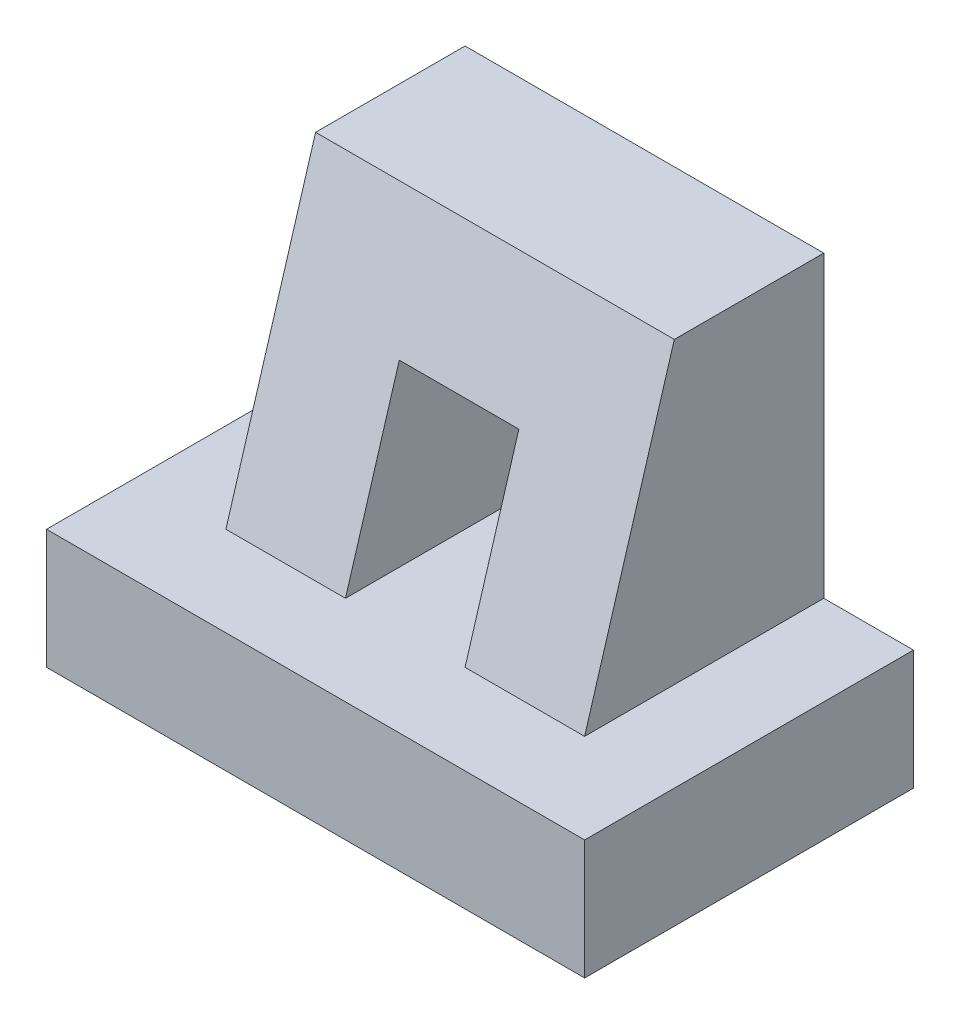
ISO-10303-21;
HEADER;
FILE_DESCRIPTION(('STEP AP214'),'2;1');
FILE_NAME('part.step','',(''),(''),'','','');
FILE_SCHEMA(('AUTOMOTIVE_DESIGN { 1 0 10303 214 1 1 1 1 }'));
ENDSEC;
DATA;
#1=APPLICATION_CONTEXT('core data for automotive mechanical design processes');
#2=APPLICATION_PROTOCOL_DEFINITION('international standard','automotive_design',2000,#1);
#3=PRODUCT_CONTEXT('',#1,'mechanical');
#4=PRODUCT('Part','Part','',(#3));
#5=PRODUCT_RELATED_PRODUCT_CATEGORY('part','',(#4));
#6=PRODUCT_DEFINITION_FORMATION('','',#4);
#7=PRODUCT_DEFINITION_CONTEXT('part definition',#1,'design');
#8=PRODUCT_DEFINITION('design','',#6,#7);
#9=PRODUCT_DEFINITION_SHAPE('','',#8);
#10=(LENGTH_UNIT() NAMED_UNIT(*) SI_UNIT(.MILLI.,.METRE.));
#11=(NAMED_UNIT(*) PLANE_ANGLE_UNIT() SI_UNIT($,.RADIAN.));
#12=(NAMED_UNIT(*) SI_UNIT($,.STERADIAN.) SOLID_ANGLE_UNIT());
#13=UNCERTAINTY_MEASURE_WITH_UNIT(LENGTH_MEASURE(1.E-05),#10,'distance_accuracy_value','');
#14=(GEOMETRIC_REPRESENTATION_CONTEXT(3) GLOBAL_UNCERTAINTY_ASSIGNED_CONTEXT((#13)) GLOBAL_UNIT_ASSIGNED_CONTEXT((#10,
#11,#12)) REPRESENTATION_CONTEXT('',''));
#15=CARTESIAN_POINT('',(0.,0.,0.));
#16=DIRECTION('',(0.,0.,1.));
#17=DIRECTION('',(1.,0.,0.));
#18=AXIS2_PLACEMENT_3D('',#15,#16,#17);
#19=CARTESIAN_POINT('',(0.,20.,0.));
#20=DIRECTION('',(1.,0.,0.));
#21=DIRECTION('',(0.,0.,-1.));
#22=AXIS2_PLACEMENT_3D('',#19,#20,#21);
#23=PLANE('',#22);
#24=DIRECTION('',(0.,0.,1.));
#25=VECTOR('',#24,1.);
#26=CARTESIAN_POINT('',(0.,0.,0.));
#27=LINE('',#26,#25);
#28=CARTESIAN_POINT('',(0.,0.,-55.));
#29=VERTEX_POINT('',#28);
#30=CARTESIAN_POINT('',(0.,0.,0.));
#31=VERTEX_POINT('',#30);
#32=EDGE_CURVE('E202',#29,#31,#27,.T.);
#33=ORIENTED_EDGE('',*,*,#32,.T.);
#34=DIRECTION('',(0.,-1.,0.));
#35=VECTOR('',#34,1.);
#36=CARTESIAN_POINT('',(0.,20.,0.));
#37=LINE('',#36,#35);
#38=CARTESIAN_POINT('',(0.,20.,0.));
#39=VERTEX_POINT('',#38);
#40=EDGE_CURVE('E168',#39,#31,#37,.T.);
#41=ORIENTED_EDGE('',*,*,#40,.F.);
#42=DIRECTION('',(0.,0.,1.));
#43=VECTOR('',#42,1.);
#44=CARTESIAN_POINT('',(0.,20.,0.));
#45=LINE('',#44,#43);
#46=CARTESIAN_POINT('',(0.,20.,-55.));
#47=VERTEX_POINT('',#46);
#48=EDGE_CURVE('E224',#47,#39,#45,.T.);
#49=ORIENTED_EDGE('',*,*,#48,.F.);
#50=DIRECTION('',(0.,-1.,0.));
#51=VECTOR('',#50,1.);
#52=CARTESIAN_POINT('',(0.,20.,-55.));
#53=LINE('',#52,#51);
#54=EDGE_CURVE('E206',#47,#29,#53,.T.);
#55=ORIENTED_EDGE('',*,*,#54,.T.);
#56=EDGE_LOOP('',(#33,#41,#49,#55));
#57=FACE_BOUND('',#56,.T.);
#58=ADVANCED_FACE('F31',(#57),#23,.F.);
#59=CARTESIAN_POINT('',(0.,20.,0.));
#60=DIRECTION('',(0.,0.,-1.));
#61=DIRECTION('',(-1.,0.,0.));
#62=AXIS2_PLACEMENT_3D('',#59,#60,#61);
#63=PLANE('',#62);
#64=DIRECTION('',(1.,0.,0.));
#65=VECTOR('',#64,1.);
#66=CARTESIAN_POINT('',(0.,0.,0.));
#67=LINE('',#66,#65);
#68=CARTESIAN_POINT('',(90.,0.,0.));
#69=VERTEX_POINT('',#68);
#70=EDGE_CURVE('E209',#31,#69,#67,.T.);
#71=ORIENTED_EDGE('',*,*,#70,.T.);
#72=DIRECTION('',(0.,-1.,0.));
#73=VECTOR('',#72,1.);
#74=CARTESIAN_POINT('',(90.,20.,0.));
#75=LINE('',#74,#73);
#76=CARTESIAN_POINT('',(90.,20.,0.));
#77=VERTEX_POINT('',#76);
#78=EDGE_CURVE('E230',#77,#69,#75,.T.);
#79=ORIENTED_EDGE('',*,*,#78,.F.);
#80=DIRECTION('',(1.,0.,0.));
#81=VECTOR('',#80,1.);
#82=CARTESIAN_POINT('',(0.,20.,0.));
#83=LINE('',#82,#81);
#84=EDGE_CURVE('E262',#39,#77,#83,.T.);
#85=ORIENTED_EDGE('',*,*,#84,.F.);
#86=ORIENTED_EDGE('',*,*,#40,.T.);
#87=EDGE_LOOP('',(#71,#79,#85,#86));
#88=FACE_BOUND('',#87,.T.);
#89=ADVANCED_FACE('F191',(#88),#63,.F.);
#90=CARTESIAN_POINT('',(90.,20.,0.));
#91=DIRECTION('',(-1.,0.,0.));
#92=DIRECTION('',(0.,0.,1.));
#93=AXIS2_PLACEMENT_3D('',#90,#91,#92);
#94=PLANE('',#93);
#95=DIRECTION('',(0.,0.,-1.));
#96=VECTOR('',#95,1.);
#97=CARTESIAN_POINT('',(90.,0.,0.));
#98=LINE('',#97,#96);
#99=CARTESIAN_POINT('',(90.,0.,-55.));
#100=VERTEX_POINT('',#99);
#101=EDGE_CURVE('E212',#69,#100,#98,.T.);
#102=ORIENTED_EDGE('',*,*,#101,.T.);
#103=DIRECTION('',(0.,-1.,0.));
#104=VECTOR('',#103,1.);
#105=CARTESIAN_POINT('',(90.,20.,-55.));
#106=LINE('',#105,#104);
#107=CARTESIAN_POINT('',(90.,20.,-55.));
#108=VERTEX_POINT('',#107);
#109=EDGE_CURVE('E226',#108,#100,#106,.T.);
#110=ORIENTED_EDGE('',*,*,#109,.F.);
#111=DIRECTION('',(0.,0.,-1.));
#112=VECTOR('',#111,1.);
#113=CARTESIAN_POINT('',(90.,20.,0.));
#114=LINE('',#113,#112);
#115=EDGE_CURVE('E238',#77,#108,#114,.T.);
#116=ORIENTED_EDGE('',*,*,#115,.F.);
#117=ORIENTED_EDGE('',*,*,#78,.T.);
#118=EDGE_LOOP('',(#102,#110,#116,#117));
#119=FACE_BOUND('',#118,.T.);
#120=ADVANCED_FACE('F196',(#119),#94,.F.);
#121=CARTESIAN_POINT('',(0.,20.,-55.));
#122=DIRECTION('',(0.,0.,1.));
#123=DIRECTION('',(1.,0.,0.));
#124=AXIS2_PLACEMENT_3D('',#121,#122,#123);
#125=PLANE('',#124);
#126=DIRECTION('',(-1.,0.,0.));
#127=VECTOR('',#126,1.);
#128=CARTESIAN_POINT('',(0.,50.,-55.));
#129=LINE('',#128,#127);
#130=CARTESIAN_POINT('',(55.,50.,-55.));
#131=VERTEX_POINT('',#130);
#132=CARTESIAN_POINT('',(35.,50.,-55.));
#133=VERTEX_POINT('',#132);
#134=EDGE_CURVE('E134',#131,#133,#129,.T.);
#135=ORIENTED_EDGE('',*,*,#134,.T.);
#136=DIRECTION('',(0.,-1.,0.));
#137=VECTOR('',#136,1.);
#138=CARTESIAN_POINT('',(35.,20.,-55.));
#139=LINE('',#138,#137);
#140=CARTESIAN_POINT('',(35.,20.,-55.));
#141=VERTEX_POINT('',#140);
#142=EDGE_CURVE('E127',#133,#141,#139,.T.);
#143=ORIENTED_EDGE('',*,*,#142,.T.);
#144=DIRECTION('',(1.,0.,0.));
#145=VECTOR('',#144,1.);
#146=CARTESIAN_POINT('',(0.,20.,-55.));
#147=LINE('',#146,#145);
#148=CARTESIAN_POINT('',(55.,20.,-55.));
#149=VERTEX_POINT('',#148);
#150=EDGE_CURVE('E116',#141,#149,#147,.T.);
#151=ORIENTED_EDGE('',*,*,#150,.T.);
#152=DIRECTION('',(0.,1.,0.));
#153=VECTOR('',#152,1.);
#154=CARTESIAN_POINT('',(55.,20.,-55.));
#155=LINE('',#154,#153);
#156=EDGE_CURVE('E121',#149,#131,#155,.T.);
#157=ORIENTED_EDGE('',*,*,#156,.T.);
#158=EDGE_LOOP('',(#135,#143,#151,#157));
#159=FACE_BOUND('',#158,.T.);
#160=DIRECTION('',(-1.,0.,0.));
#161=VECTOR('',#160,1.);
#162=CARTESIAN_POINT('',(0.,0.,-55.));
#163=LINE('',#162,#161);
#164=EDGE_CURVE('E222',#100,#29,#163,.T.);
#165=ORIENTED_EDGE('',*,*,#164,.T.);
#166=ORIENTED_EDGE('',*,*,#54,.F.);
#167=DIRECTION('',(-1.,0.,0.));
#168=VECTOR('',#167,1.);
#169=CARTESIAN_POINT('',(0.,20.,-55.));
#170=LINE('',#169,#168);
#171=CARTESIAN_POINT('',(15.,20.,-55.));
#172=VERTEX_POINT('',#171);
#173=EDGE_CURVE('E236',#172,#47,#170,.T.);
#174=ORIENTED_EDGE('',*,*,#173,.F.);
#175=DIRECTION('',(0.,1.,0.));
#176=VECTOR('',#175,1.);
#177=CARTESIAN_POINT('',(15.,70.,-55.));
#178=LINE('',#177,#176);
#179=CARTESIAN_POINT('',(15.,70.,-55.));
#180=VERTEX_POINT('',#179);
#181=EDGE_CURVE('E135',#172,#180,#178,.T.);
#182=ORIENTED_EDGE('',*,*,#181,.T.);
#183=DIRECTION('',(-1.,0.,0.));
#184=VECTOR('',#183,1.);
#185=CARTESIAN_POINT('',(75.,70.,-55.));
#186=LINE('',#185,#184);
#187=CARTESIAN_POINT('',(75.,70.,-55.));
#188=VERTEX_POINT('',#187);
#189=EDGE_CURVE('E210',#188,#180,#186,.T.);
#190=ORIENTED_EDGE('',*,*,#189,.F.);
#191=DIRECTION('',(0.,1.,0.));
#192=VECTOR('',#191,1.);
#193=CARTESIAN_POINT('',(75.,70.,-55.));
#194=LINE('',#193,#192);
#195=CARTESIAN_POINT('',(75.,20.,-55.));
#196=VERTEX_POINT('',#195);
#197=EDGE_CURVE('E146',#196,#188,#194,.T.);
#198=ORIENTED_EDGE('',*,*,#197,.F.);
#199=EDGE_CURVE('E227',#108,#196,#170,.T.);
#200=ORIENTED_EDGE('',*,*,#199,.F.);
#201=ORIENTED_EDGE('',*,*,#109,.T.);
#202=EDGE_LOOP('',(#165,#166,#174,#182,#190,#198,#200,#201));
#203=FACE_BOUND('',#202,.T.);
#204=ADVANCED_FACE('F132',(#159,#203),#125,.F.);
#205=CARTESIAN_POINT('',(0.,20.,-55.));
#206=DIRECTION('',(0.,-1.,0.));
#207=DIRECTION('',(0.,0.,-1.));
#208=AXIS2_PLACEMENT_3D('',#205,#206,#207);
#209=PLANE('',#208);
#210=DIRECTION('',(-1.,0.,0.));
#211=VECTOR('',#210,1.);
#212=CARTESIAN_POINT('',(75.,20.,-15.));
#213=LINE('',#212,#211);
#214=CARTESIAN_POINT('',(75.,20.,-15.));
#215=VERTEX_POINT('',#214);
#216=CARTESIAN_POINT('',(55.,20.,-15.));
#217=VERTEX_POINT('',#216);
#218=EDGE_CURVE('E156',#215,#217,#213,.T.);
#219=ORIENTED_EDGE('',*,*,#218,.T.);
#220=DIRECTION('',(0.,0.,1.));
#221=VECTOR('',#220,1.);
#222=CARTESIAN_POINT('',(55.,20.,-55.00005));
#223=LINE('',#222,#221);
#224=EDGE_CURVE('E45',#149,#217,#223,.T.);
#225=ORIENTED_EDGE('',*,*,#224,.F.);
#226=ORIENTED_EDGE('',*,*,#150,.F.);
#227=DIRECTION('',(0.,0.,1.));
#228=VECTOR('',#227,1.);
#229=CARTESIAN_POINT('',(35.,20.,-55.00005));
#230=LINE('',#229,#228);
#231=CARTESIAN_POINT('',(35.,20.,-15.));
#232=VERTEX_POINT('',#231);
#233=EDGE_CURVE('E51',#141,#232,#230,.T.);
#234=ORIENTED_EDGE('',*,*,#233,.T.);
#235=CARTESIAN_POINT('',(15.,20.,-15.));
#236=VERTEX_POINT('',#235);
#237=EDGE_CURVE('E240',#232,#236,#213,.T.);
#238=ORIENTED_EDGE('',*,*,#237,.T.);
#239=DIRECTION('',(0.,0.,-1.));
#240=VECTOR('',#239,1.);
#241=CARTESIAN_POINT('',(15.,20.,-55.));
#242=LINE('',#241,#240);
#243=EDGE_CURVE('E153',#236,#172,#242,.T.);
#244=ORIENTED_EDGE('',*,*,#243,.T.);
#245=ORIENTED_EDGE('',*,*,#173,.T.);
#246=ORIENTED_EDGE('',*,*,#48,.T.);
#247=ORIENTED_EDGE('',*,*,#84,.T.);
#248=ORIENTED_EDGE('',*,*,#115,.T.);
#249=ORIENTED_EDGE('',*,*,#199,.T.);
#250=DIRECTION('',(0.,0.,-1.));
#251=VECTOR('',#250,1.);
#252=CARTESIAN_POINT('',(75.,20.,-55.));
#253=LINE('',#252,#251);
#254=EDGE_CURVE('E148',#215,#196,#253,.T.);
#255=ORIENTED_EDGE('',*,*,#254,.F.);
#256=EDGE_LOOP('',(#219,#225,#226,#234,#238,#244,#245,#246,#247,#248,#249,#255));
#257=FACE_BOUND('',#256,.T.);
#258=ADVANCED_FACE('F117',(#257),#209,.F.);
#259=CARTESIAN_POINT('',(0.,0.,-55.));
#260=DIRECTION('',(0.,-1.,0.));
#261=DIRECTION('',(0.,0.,-1.));
#262=AXIS2_PLACEMENT_3D('',#259,#260,#261);
#263=PLANE('',#262);
#264=ORIENTED_EDGE('',*,*,#32,.F.);
#265=ORIENTED_EDGE('',*,*,#164,.F.);
#266=ORIENTED_EDGE('',*,*,#101,.F.);
#267=ORIENTED_EDGE('',*,*,#70,.F.);
#268=EDGE_LOOP('',(#264,#265,#266,#267));
#269=FACE_BOUND('',#268,.T.);
#270=ADVANCED_FACE('F260',(#269),#263,.T.);
#271=CARTESIAN_POINT('',(75.,70.,-30.));
#272=DIRECTION('',(0.,-1.,0.));
#273=DIRECTION('',(0.,0.,-1.));
#274=AXIS2_PLACEMENT_3D('',#271,#272,#273);
#275=PLANE('',#274);
#276=DIRECTION('',(0.,0.,1.));
#277=VECTOR('',#276,1.);
#278=CARTESIAN_POINT('',(15.,70.,-30.));
#279=LINE('',#278,#277);
#280=CARTESIAN_POINT('',(15.,70.,-30.));
#281=VERTEX_POINT('',#280);
#282=EDGE_CURVE('E138',#180,#281,#279,.T.);
#283=ORIENTED_EDGE('',*,*,#282,.T.);
#284=DIRECTION('',(-1.,0.,0.));
#285=VECTOR('',#284,1.);
#286=CARTESIAN_POINT('',(75.,70.,-30.));
#287=LINE('',#286,#285);
#288=CARTESIAN_POINT('',(75.,70.,-30.));
#289=VERTEX_POINT('',#288);
#290=EDGE_CURVE('E215',#289,#281,#287,.T.);
#291=ORIENTED_EDGE('',*,*,#290,.F.);
#292=DIRECTION('',(0.,0.,1.));
#293=VECTOR('',#292,1.);
#294=CARTESIAN_POINT('',(75.,70.,-30.));
#295=LINE('',#294,#293);
#296=EDGE_CURVE('E143',#188,#289,#295,.T.);
#297=ORIENTED_EDGE('',*,*,#296,.F.);
#298=ORIENTED_EDGE('',*,*,#189,.T.);
#299=EDGE_LOOP('',(#283,#291,#297,#298));
#300=FACE_BOUND('',#299,.T.);
#301=ADVANCED_FACE('F252',(#300),#275,.F.);
#302=CARTESIAN_POINT('',(75.,20.,-15.));
#303=DIRECTION('',(0.,-0.287347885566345,-0.957826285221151));
#304=DIRECTION('',(0.,0.957826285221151,-0.287347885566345));
#305=AXIS2_PLACEMENT_3D('',#302,#303,#304);
#306=PLANE('',#305);
#307=ORIENTED_EDGE('',*,*,#237,.F.);
#308=DIRECTION('',(0.,0.957826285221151,-0.287347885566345));
#309=VECTOR('',#308,1.);
#310=CARTESIAN_POINT('',(35.,20.,-15.));
#311=LINE('',#310,#309);
#312=CARTESIAN_POINT('',(35.,50.,-24.));
#313=VERTEX_POINT('',#312);
#314=EDGE_CURVE('E11',#232,#313,#311,.T.);
#315=ORIENTED_EDGE('',*,*,#314,.T.);
#316=DIRECTION('',(1.,0.,0.));
#317=VECTOR('',#316,1.);
#318=CARTESIAN_POINT('',(75.,50.,-24.));
#319=LINE('',#318,#317);
#320=CARTESIAN_POINT('',(55.,50.,-24.));
#321=VERTEX_POINT('',#320);
#322=EDGE_CURVE('E38',#313,#321,#319,.T.);
#323=ORIENTED_EDGE('',*,*,#322,.T.);
#324=DIRECTION('',(0.,-0.957826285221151,0.287347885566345));
#325=VECTOR('',#324,1.);
#326=CARTESIAN_POINT('',(55.,20.,-15.));
#327=LINE('',#326,#325);
#328=EDGE_CURVE('E166',#321,#217,#327,.T.);
#329=ORIENTED_EDGE('',*,*,#328,.T.);
#330=ORIENTED_EDGE('',*,*,#218,.F.);
#331=DIRECTION('',(0.,-0.957826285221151,0.287347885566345));
#332=VECTOR('',#331,1.);
#333=CARTESIAN_POINT('',(75.,20.,-15.));
#334=LINE('',#333,#332);
#335=EDGE_CURVE('E145',#289,#215,#334,.T.);
#336=ORIENTED_EDGE('',*,*,#335,.F.);
#337=ORIENTED_EDGE('',*,*,#290,.T.);
#338=DIRECTION('',(0.,-0.957826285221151,0.287347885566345));
#339=VECTOR('',#338,1.);
#340=CARTESIAN_POINT('',(15.,20.,-15.));
#341=LINE('',#340,#339);
#342=EDGE_CURVE('E150',#281,#236,#341,.T.);
#343=ORIENTED_EDGE('',*,*,#342,.T.);
#344=EDGE_LOOP('',(#307,#315,#323,#329,#330,#336,#337,#343));
#345=FACE_BOUND('',#344,.T.);
#346=ADVANCED_FACE('F171',(#345),#306,.F.);
#347=CARTESIAN_POINT('',(75.,70.,-55.));
#348=DIRECTION('',(1.,0.,0.));
#349=DIRECTION('',(0.,0.,-1.));
#350=AXIS2_PLACEMENT_3D('',#347,#348,#349);
#351=PLANE('',#350);
#352=ORIENTED_EDGE('',*,*,#197,.T.);
#353=ORIENTED_EDGE('',*,*,#296,.T.);
#354=ORIENTED_EDGE('',*,*,#335,.T.);
#355=ORIENTED_EDGE('',*,*,#254,.T.);
#356=EDGE_LOOP('',(#352,#353,#354,#355));
#357=FACE_BOUND('',#356,.T.);
#358=ADVANCED_FACE('F246',(#357),#351,.T.);
#359=CARTESIAN_POINT('',(15.,70.,-55.));
#360=DIRECTION('',(1.,0.,0.));
#361=DIRECTION('',(0.,0.,-1.));
#362=AXIS2_PLACEMENT_3D('',#359,#360,#361);
#363=PLANE('',#362);
#364=ORIENTED_EDGE('',*,*,#181,.F.);
#365=ORIENTED_EDGE('',*,*,#243,.F.);
#366=ORIENTED_EDGE('',*,*,#342,.F.);
#367=ORIENTED_EDGE('',*,*,#282,.F.);
#368=EDGE_LOOP('',(#364,#365,#366,#367));
#369=FACE_BOUND('',#368,.T.);
#370=ADVANCED_FACE('F268',(#369),#363,.F.);
#371=CARTESIAN_POINT('',(35.,50.,-55.00005));
#372=DIRECTION('',(-1.,0.,0.));
#373=DIRECTION('',(0.,0.,1.));
#374=AXIS2_PLACEMENT_3D('',#371,#372,#373);
#375=PLANE('',#374);
#376=DIRECTION('',(0.,0.,1.));
#377=VECTOR('',#376,1.);
#378=CARTESIAN_POINT('',(35.,50.,-55.00005));
#379=LINE('',#378,#377);
#380=EDGE_CURVE('E122',#133,#313,#379,.T.);
#381=ORIENTED_EDGE('',*,*,#380,.T.);
#382=ORIENTED_EDGE('',*,*,#314,.F.);
#383=ORIENTED_EDGE('',*,*,#233,.F.);
#384=ORIENTED_EDGE('',*,*,#142,.F.);
#385=EDGE_LOOP('',(#381,#382,#383,#384));
#386=FACE_BOUND('',#385,.T.);
#387=ADVANCED_FACE('F126',(#386),#375,.F.);
#388=CARTESIAN_POINT('',(35.,50.,-55.00005));
#389=DIRECTION('',(0.,1.,0.));
#390=DIRECTION('',(0.,0.,1.));
#391=AXIS2_PLACEMENT_3D('',#388,#389,#390);
#392=PLANE('',#391);
#393=DIRECTION('',(0.,0.,1.));
#394=VECTOR('',#393,1.);
#395=CARTESIAN_POINT('',(55.,50.,-55.00005));
#396=LINE('',#395,#394);
#397=EDGE_CURVE('E177',#131,#321,#396,.T.);
#398=ORIENTED_EDGE('',*,*,#397,.T.);
#399=ORIENTED_EDGE('',*,*,#322,.F.);
#400=ORIENTED_EDGE('',*,*,#380,.F.);
#401=ORIENTED_EDGE('',*,*,#134,.F.);
#402=EDGE_LOOP('',(#398,#399,#400,#401));
#403=FACE_BOUND('',#402,.T.);
#404=ADVANCED_FACE('F175',(#403),#392,.F.);
#405=CARTESIAN_POINT('',(55.,50.,-55.00005));
#406=DIRECTION('',(1.,0.,0.));
#407=DIRECTION('',(0.,1.,0.));
#408=AXIS2_PLACEMENT_3D('',#405,#406,#407);
#409=PLANE('',#408);
#410=ORIENTED_EDGE('',*,*,#224,.T.);
#411=ORIENTED_EDGE('',*,*,#328,.F.);
#412=ORIENTED_EDGE('',*,*,#397,.F.);
#413=ORIENTED_EDGE('',*,*,#156,.F.);
#414=EDGE_LOOP('',(#410,#411,#412,#413));
#415=FACE_BOUND('',#414,.T.);
#416=ADVANCED_FACE('F182',(#415),#409,.F.);
#417=CLOSED_SHELL('',(#58,#89,#120,#204,#258,#270,#301,#346,#358,#370,#387,#404,#416));
#418=MANIFOLD_SOLID_BREP('B2',#417);
#419=ADVANCED_BREP_SHAPE_REPRESENTATION('',(#18,#418),#14);
#420=SHAPE_DEFINITION_REPRESENTATION(#9,#419);
ENDSEC;
END-ISO-10303-21;
